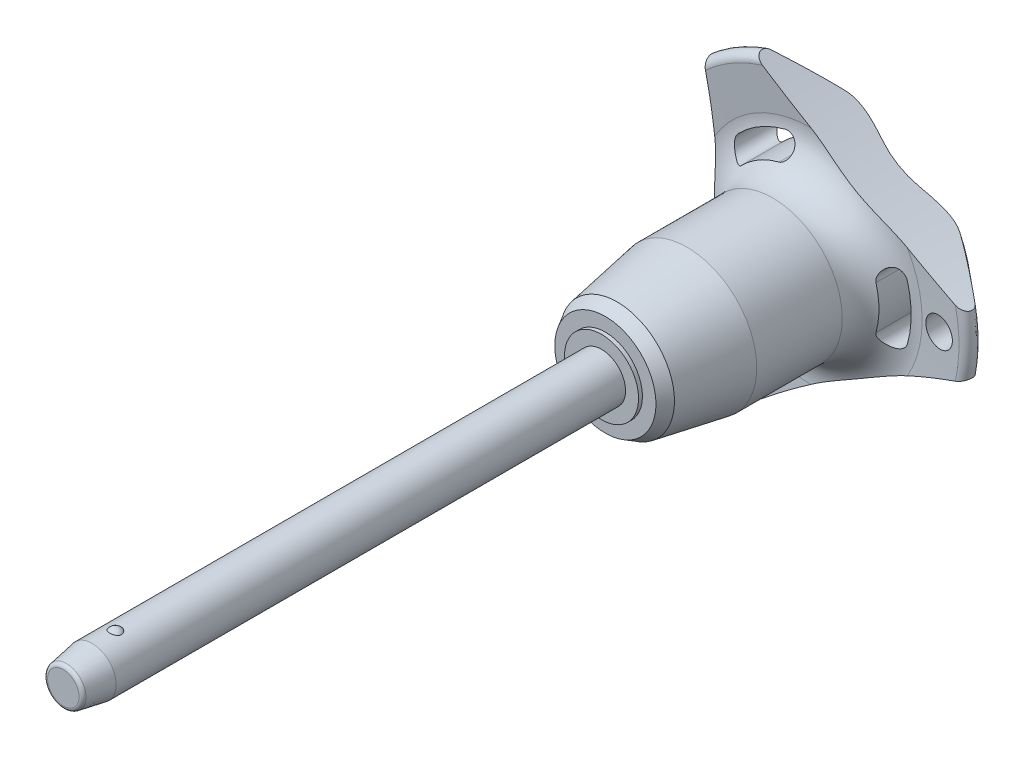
from build123d import *

# Parameters (mm, degrees)
SKETCH1_R           = 2.5
BOSS_EXTRUDE1_DEPTH = 50
SKETCH2_R           = 2.1
BOSS_EXTRUDE2_DEPTH = 26.7
BOSS_EXTRUDE3_START = 6
SKETCH1_2_R         = 2.5
BOSS_EXTRUDE3_DEPTH = 6
CHAMFER1_SIZE       = 3
CHAMFER1_SIZE2      = 0.528980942
FILLET1_R           = 0.4
SKETCH6_R           = 79.96
CUT_EXTRUDE1_DEPTH  = 81.212991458
CIRPATTERN1_COUNT   = 3
SKETCH7_R           = 1.5
CUT_EXTRUDE2_DEPTH  = 81.023009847


with BuildPart() as part:
    # Sketch1 → Boss-Extrude1 (new body)
    with BuildSketch(Plane.XY):
        Circle(SKETCH1_R)
    extrude(amount=-BOSS_EXTRUDE1_DEPTH)

    # Sketch2 → Boss-Extrude2 (add)
    with BuildSketch(Plane(origin=(0, 0, -50), x_dir=(-1, 0, 0), z_dir=(0, 0, -1))):
        Circle(SKETCH2_R)
    extrude(amount=BOSS_EXTRUDE2_DEPTH)

    # Sketch3 → Revolve1 (revolve)
    with BuildSketch(Plane(origin=(0, 0, 0), x_dir=(0, 0, -1), z_dir=(1, 0, 0))):
        with BuildLine():
            Line((-0.580947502, 2.75), (-0.580947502, 1.15))
            ThreePointArc((-0.580947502, 1.15), (0.219052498, 1.95), (-0.580947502, 2.75))
        make_face()
        with BuildLine():
            Line((-0.580947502, -1.15), (-0.580947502, -2.75))
            ThreePointArc((-0.580947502, -2.75), (0.219052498, -1.95), (-0.580947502, -1.15))
        make_face()
    revolve(axis=Axis((0, -1.15, 0.580947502), (0, 1, 0)))

    # Sketch1_2 → Boss-Extrude3 (add)
    with BuildSketch(Plane.XY.offset(BOSS_EXTRUDE3_START)):
        Circle(SKETCH1_2_R)
    extrude(amount=-BOSS_EXTRUDE3_DEPTH)

    # Chamfer1
    chamfer1_edges = [part.edges().sort_by_distance(p)[0] for p in [
        (-2.5, 0, 6),
    ]]
    chamfer1_side = [part.faces().sort_by_distance(p)[0] for p in [
        (-2.5, 0, -22),
    ]]
    chamfer(chamfer1_edges, length=CHAMFER1_SIZE, length2=CHAMFER1_SIZE2, reference=chamfer1_side[0])

    # Fillet1
    fillet1_edges = [part.edges().sort_by_distance(p)[0] for p in [
        (-1.971019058, 0, 6),
        (2.1, 0, -76.7),
    ]]
    fillet(fillet1_edges, radius=FILLET1_R)

    # Sketch4 → Revolve2 (revolve)
    with BuildSketch(Plane(origin=(0, 0, 0), x_dir=(0, 0, -1), z_dir=(1, 0, 0)), mode=Mode.PRIVATE) as revolve2_sk:
        Polygon((50, 0), (50, 3.851837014), (50.4, 3.851837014), (50.4, 5.26161122), (51.620900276, 5.966498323), (58.9, 7.25), (67.8, 7.25), (67.8, 0), align=None)
    revolve(revolve2_sk.sketch.rotate(Axis((0, 0, -67.8), (0, 0, 1)), 90), axis=Axis((0, 0, -67.8), (0, 0, 1)))

    # Sketch5 → Revolve3 (revolve)
    with BuildSketch(Plane(origin=(0, 0, 0), x_dir=(0, 0, -1), z_dir=(1, 0, 0)), mode=Mode.PRIVATE) as revolve3_sk:
        with BuildLine():
            Line((71.78715932, 11.570250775), (71.452568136, 15.735949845))
            ThreePointArc((71.452568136, 15.735949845), (71.946485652, 16.540188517), (72.862835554, 16.314230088))
            Line((72.862835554, 16.314230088), (76.326414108, 12.186497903))
            ThreePointArc((76.326414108, 12.186497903), (76.7, 11.109282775), (76.261488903, 10.056825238))
            ThreePointArc((76.261488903, 10.056825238), (73.289873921, 5.413681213), (72.25, 0))
            Line((72.25, 0), (67.8, 0))
            Line((67.8, 0), (67.8, 7.25))
            ThreePointArc((67.8, 7.25), (70.739473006, 8.537160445), (71.78715932, 11.570250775))
        make_face()
    revolve(revolve3_sk.sketch.rotate(Axis((0, 0, -72.25), (0, 0, 1)), 90), axis=Axis((0, 0, -72.25), (0, 0, 1)))

    # Sketch6 → Cut-Extrude1 (cut, through all)
    with BuildSketch(Plane.XY):
        with Locations((-89.76, 0)):
            Circle(SKETCH6_R)
        with BuildLine():
            ThreePointArc((10.099921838, -2.834717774), (10.490188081, 0), (10.099921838, 2.834717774))
            ThreePointArc((10.099921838, 2.834717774), (8.768180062, 3.582738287), (8.020159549, 2.250996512))
            ThreePointArc((8.020159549, 2.250996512), (8.330062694, 0), (8.020159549, -2.250996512))
            ThreePointArc((8.020159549, -2.250996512), (8.768180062, -3.582738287), (10.099921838, -2.834717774))
        make_face()
    cut_extrude1 = extrude(amount=-CUT_EXTRUDE1_DEPTH, mode=Mode.SUBTRACT)

    # CirPattern1: Cut-Extrude1 ×3 about axis
    cirpattern1_axis = Axis((0, 0, 0), (0, 0, 1))
    for i in range(1, CIRPATTERN1_COUNT):
        add(cut_extrude1.rotate(cirpattern1_axis, i * 360 / CIRPATTERN1_COUNT), mode=Mode.SUBTRACT)

    # Sketch7 → Cut-Extrude2 (cut, through all)
    with BuildSketch(Plane.XY):
        with Locations(Location((13.490188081, 0, 0), (0, 0, 225.221865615))):
            Circle(SKETCH7_R)
    extrude(amount=-CUT_EXTRUDE2_DEPTH, mode=Mode.SUBTRACT)


solid = part.part
